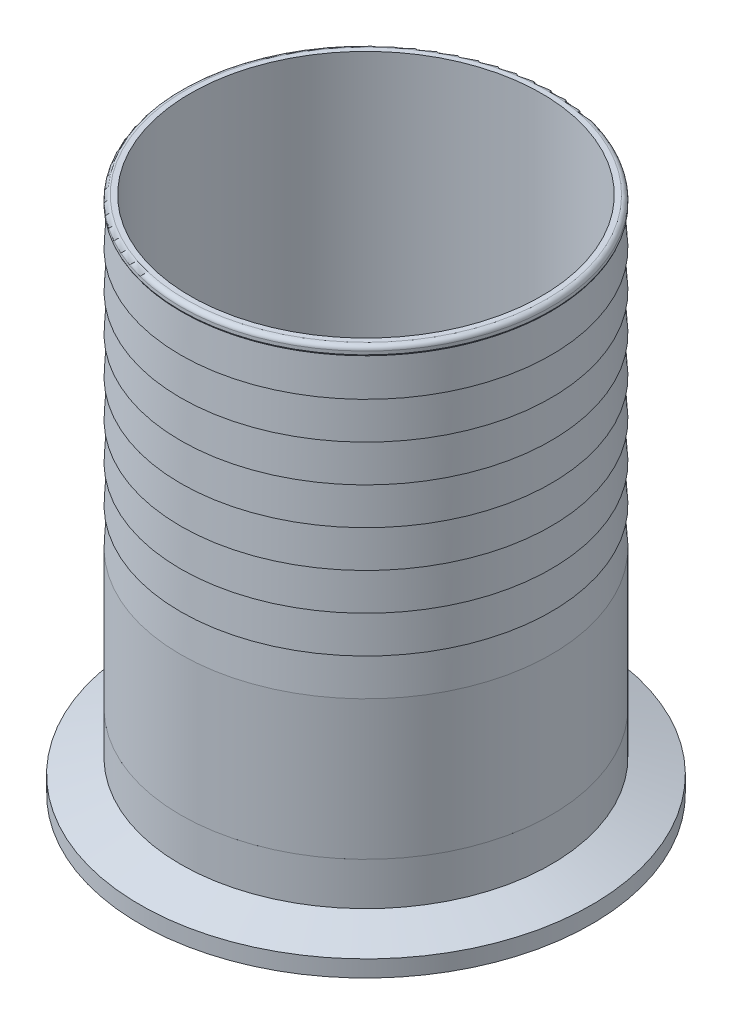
ISO-10303-21;
HEADER;
FILE_DESCRIPTION(('STEP AP214'),'2;1');
FILE_NAME('part.step','',(''),(''),'','','');
FILE_SCHEMA(('AUTOMOTIVE_DESIGN { 1 0 10303 214 1 1 1 1 }'));
ENDSEC;
DATA;
#1=APPLICATION_CONTEXT('core data for automotive mechanical design processes');
#2=APPLICATION_PROTOCOL_DEFINITION('international standard','automotive_design',2000,#1);
#3=PRODUCT_CONTEXT('',#1,'mechanical');
#4=PRODUCT('Part','Part','',(#3));
#5=PRODUCT_RELATED_PRODUCT_CATEGORY('part','',(#4));
#6=PRODUCT_DEFINITION_FORMATION('','',#4);
#7=PRODUCT_DEFINITION_CONTEXT('part definition',#1,'design');
#8=PRODUCT_DEFINITION('design','',#6,#7);
#9=PRODUCT_DEFINITION_SHAPE('','',#8);
#10=(LENGTH_UNIT() NAMED_UNIT(*) SI_UNIT(.MILLI.,.METRE.));
#11=(NAMED_UNIT(*) PLANE_ANGLE_UNIT() SI_UNIT($,.RADIAN.));
#12=(NAMED_UNIT(*) SI_UNIT($,.STERADIAN.) SOLID_ANGLE_UNIT());
#13=UNCERTAINTY_MEASURE_WITH_UNIT(LENGTH_MEASURE(1.E-05),#10,'distance_accuracy_value','');
#14=(GEOMETRIC_REPRESENTATION_CONTEXT(3) GLOBAL_UNCERTAINTY_ASSIGNED_CONTEXT((#13)) GLOBAL_UNIT_ASSIGNED_CONTEXT((#10,
#11,#12)) REPRESENTATION_CONTEXT('',''));
#15=CARTESIAN_POINT('',(0.,0.,0.));
#16=DIRECTION('',(0.,0.,1.));
#17=DIRECTION('',(1.,0.,0.));
#18=AXIS2_PLACEMENT_3D('',#15,#16,#17);
#19=CARTESIAN_POINT('',(42.3377708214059,43.5004491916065,31.3804772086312));
#20=DIRECTION('',(0.,-1.,0.));
#21=DIRECTION('',(-0.977270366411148,0.,-0.211996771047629));
#22=AXIS2_PLACEMENT_3D('',#19,#20,#21);
#23=PLANE('',#22);
#24=CARTESIAN_POINT('',(35.6068733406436,43.5004491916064,62.4088113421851));
#25=DIRECTION('',(0.,-1.,0.));
#26=DIRECTION('',(-0.977270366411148,0.,-0.211996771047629));
#27=AXIS2_PLACEMENT_3D('',#24,#25,#26);
#28=CIRCLE('',#27,30.099);
#29=CARTESIAN_POINT('',(6.19201258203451,43.5004491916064,56.0279205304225));
#30=VERTEX_POINT('',#29);
#31=EDGE_CURVE('P0_E85',#30,#30,#28,.T.);
#32=ORIENTED_EDGE('',*,*,#31,.F.);
#33=EDGE_LOOP('',(#32));
#34=FACE_BOUND('',#33,.T.);
#35=CARTESIAN_POINT('',(35.6068733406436,43.5004491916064,62.4088113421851));
#36=DIRECTION('',(0.,-1.,0.));
#37=DIRECTION('',(-0.977270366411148,0.,-0.211996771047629));
#38=AXIS2_PLACEMENT_3D('',#35,#36,#37);
#39=CIRCLE('',#38,31.75);
#40=CARTESIAN_POINT('',(4.57853920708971,43.5004491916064,55.6779138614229));
#41=VERTEX_POINT('',#40);
#42=EDGE_CURVE('P0_E9',#41,#41,#39,.T.);
#43=ORIENTED_EDGE('',*,*,#42,.T.);
#44=EDGE_LOOP('',(#43));
#45=FACE_BOUND('',#44,.T.);
#46=ADVANCED_FACE('P0_F14',(#34,#45),#23,.T.);
#47=CARTESIAN_POINT('',(35.6068733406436,43.5004491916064,62.4088113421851));
#48=DIRECTION('',(0.,-1.,0.));
#49=DIRECTION('',(-0.977270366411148,0.,-0.211996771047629));
#50=AXIS2_PLACEMENT_3D('',#47,#48,#49);
#51=CYLINDRICAL_SURFACE('',#50,31.75);
#52=CARTESIAN_POINT('',(35.6068733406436,67.3256491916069,62.4088113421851));
#53=DIRECTION('',(0.,-1.,0.));
#54=DIRECTION('',(-0.977270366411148,0.,-0.211996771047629));
#55=AXIS2_PLACEMENT_3D('',#52,#53,#54);
#56=CIRCLE('',#55,31.75);
#57=CARTESIAN_POINT('',(4.57853920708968,67.3256491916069,55.6779138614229));
#58=VERTEX_POINT('',#57);
#59=EDGE_CURVE('P0_E20',#58,#58,#56,.T.);
#60=ORIENTED_EDGE('',*,*,#59,.T.);
#61=EDGE_LOOP('',(#60));
#62=FACE_BOUND('',#61,.T.);
#63=ORIENTED_EDGE('',*,*,#42,.F.);
#64=EDGE_LOOP('',(#63));
#65=FACE_BOUND('',#64,.T.);
#66=ADVANCED_FACE('P0_F101',(#62,#65),#51,.T.);
#67=CARTESIAN_POINT('',(35.6068733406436,67.3256491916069,62.4088113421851));
#68=DIRECTION('',(0.,-1.,0.));
#69=DIRECTION('',(-0.977270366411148,0.,-0.211996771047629));
#70=AXIS2_PLACEMENT_3D('',#67,#68,#69);
#71=CONICAL_SURFACE('',#70,31.75,0.0599281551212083);
#72=CARTESIAN_POINT('',(35.6068733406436,73.6756491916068,62.4088113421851));
#73=DIRECTION('',(0.,-1.,0.));
#74=DIRECTION('',(-0.977270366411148,0.,-0.211996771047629));
#75=AXIS2_PLACEMENT_3D('',#72,#73,#74);
#76=CIRCLE('',#75,31.369);
#77=CARTESIAN_POINT('',(4.95087921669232,73.6756491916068,55.758684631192));
#78=VERTEX_POINT('',#77);
#79=EDGE_CURVE('P0_E24',#78,#78,#76,.T.);
#80=ORIENTED_EDGE('',*,*,#79,.T.);
#81=EDGE_LOOP('',(#80));
#82=FACE_BOUND('',#81,.T.);
#83=ORIENTED_EDGE('',*,*,#59,.F.);
#84=EDGE_LOOP('',(#83));
#85=FACE_BOUND('',#84,.T.);
#86=ADVANCED_FACE('P0_F106',(#82,#85),#71,.T.);
#87=CARTESIAN_POINT('',(42.3377708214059,73.6756491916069,31.3804772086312));
#88=DIRECTION('',(0.,-1.,0.));
#89=DIRECTION('',(-0.977270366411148,0.,-0.211996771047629));
#90=AXIS2_PLACEMENT_3D('',#87,#88,#89);
#91=PLANE('',#90);
#92=CARTESIAN_POINT('',(35.6068733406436,73.6756491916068,62.4088113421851));
#93=DIRECTION('',(0.,-1.,0.));
#94=DIRECTION('',(-0.977270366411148,0.,-0.211996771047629));
#95=AXIS2_PLACEMENT_3D('',#92,#93,#94);
#96=CIRCLE('',#95,31.75);
#97=CARTESIAN_POINT('',(4.57853920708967,73.6756491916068,55.6779138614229));
#98=VERTEX_POINT('',#97);
#99=EDGE_CURVE('P0_E28',#98,#98,#96,.T.);
#100=ORIENTED_EDGE('',*,*,#99,.T.);
#101=EDGE_LOOP('',(#100));
#102=FACE_BOUND('',#101,.T.);
#103=ORIENTED_EDGE('',*,*,#79,.F.);
#104=EDGE_LOOP('',(#103));
#105=FACE_BOUND('',#104,.T.);
#106=ADVANCED_FACE('P0_F110',(#102,#105),#91,.T.);
#107=CARTESIAN_POINT('',(35.6068733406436,73.6756491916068,62.4088113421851));
#108=DIRECTION('',(0.,-1.,0.));
#109=DIRECTION('',(-0.977270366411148,0.,-0.211996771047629));
#110=AXIS2_PLACEMENT_3D('',#107,#108,#109);
#111=CONICAL_SURFACE('',#110,31.75,0.0599281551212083);
#112=CARTESIAN_POINT('',(35.6068733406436,80.0256491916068,62.4088113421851));
#113=DIRECTION('',(0.,-1.,0.));
#114=DIRECTION('',(-0.977270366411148,0.,-0.211996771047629));
#115=AXIS2_PLACEMENT_3D('',#112,#113,#114);
#116=CIRCLE('',#115,31.369);
#117=CARTESIAN_POINT('',(4.95087921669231,80.0256491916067,55.7586846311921));
#118=VERTEX_POINT('',#117);
#119=EDGE_CURVE('P0_E33',#118,#118,#116,.T.);
#120=ORIENTED_EDGE('',*,*,#119,.T.);
#121=EDGE_LOOP('',(#120));
#122=FACE_BOUND('',#121,.T.);
#123=ORIENTED_EDGE('',*,*,#99,.F.);
#124=EDGE_LOOP('',(#123));
#125=FACE_BOUND('',#124,.T.);
#126=ADVANCED_FACE('P0_F117',(#122,#125),#111,.T.);
#127=CARTESIAN_POINT('',(42.3377708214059,80.0256491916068,31.3804772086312));
#128=DIRECTION('',(0.,-1.,0.));
#129=DIRECTION('',(-0.977270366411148,0.,-0.211996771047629));
#130=AXIS2_PLACEMENT_3D('',#127,#128,#129);
#131=PLANE('',#130);
#132=CARTESIAN_POINT('',(35.6068733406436,80.0256491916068,62.4088113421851));
#133=DIRECTION('',(0.,-1.,0.));
#134=DIRECTION('',(-0.977270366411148,0.,-0.211996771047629));
#135=AXIS2_PLACEMENT_3D('',#132,#133,#134);
#136=CIRCLE('',#135,31.75);
#137=CARTESIAN_POINT('',(4.57853920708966,80.0256491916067,55.6779138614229));
#138=VERTEX_POINT('',#137);
#139=EDGE_CURVE('P0_E36',#138,#138,#136,.T.);
#140=ORIENTED_EDGE('',*,*,#139,.T.);
#141=EDGE_LOOP('',(#140));
#142=FACE_BOUND('',#141,.T.);
#143=ORIENTED_EDGE('',*,*,#119,.F.);
#144=EDGE_LOOP('',(#143));
#145=FACE_BOUND('',#144,.T.);
#146=ADVANCED_FACE('P0_F121',(#142,#145),#131,.T.);
#147=CARTESIAN_POINT('',(35.6068733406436,80.0256491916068,62.4088113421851));
#148=DIRECTION('',(0.,-1.,0.));
#149=DIRECTION('',(-0.977270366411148,0.,-0.211996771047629));
#150=AXIS2_PLACEMENT_3D('',#147,#148,#149);
#151=CONICAL_SURFACE('',#150,31.75,0.0599281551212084);
#152=CARTESIAN_POINT('',(35.6068733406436,86.3756491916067,62.4088113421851));
#153=DIRECTION('',(0.,-1.,0.));
#154=DIRECTION('',(-0.977270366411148,0.,-0.211996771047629));
#155=AXIS2_PLACEMENT_3D('',#152,#153,#154);
#156=CIRCLE('',#155,31.369);
#157=CARTESIAN_POINT('',(4.9508792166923,86.3756491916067,55.7586846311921));
#158=VERTEX_POINT('',#157);
#159=EDGE_CURVE('P0_E39',#158,#158,#156,.T.);
#160=ORIENTED_EDGE('',*,*,#159,.T.);
#161=EDGE_LOOP('',(#160));
#162=FACE_BOUND('',#161,.T.);
#163=ORIENTED_EDGE('',*,*,#139,.F.);
#164=EDGE_LOOP('',(#163));
#165=FACE_BOUND('',#164,.T.);
#166=ADVANCED_FACE('P0_F125',(#162,#165),#151,.T.);
#167=CARTESIAN_POINT('',(42.3377708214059,86.3756491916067,31.3804772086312));
#168=DIRECTION('',(0.,-1.,0.));
#169=DIRECTION('',(-0.977270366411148,0.,-0.211996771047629));
#170=AXIS2_PLACEMENT_3D('',#167,#168,#169);
#171=PLANE('',#170);
#172=CARTESIAN_POINT('',(35.6068733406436,86.3756491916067,62.4088113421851));
#173=DIRECTION('',(0.,-1.,0.));
#174=DIRECTION('',(-0.977270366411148,0.,-0.211996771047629));
#175=AXIS2_PLACEMENT_3D('',#172,#173,#174);
#176=CIRCLE('',#175,31.75);
#177=CARTESIAN_POINT('',(4.57853920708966,86.3756491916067,55.6779138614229));
#178=VERTEX_POINT('',#177);
#179=EDGE_CURVE('P0_E42',#178,#178,#176,.T.);
#180=ORIENTED_EDGE('',*,*,#179,.T.);
#181=EDGE_LOOP('',(#180));
#182=FACE_BOUND('',#181,.T.);
#183=ORIENTED_EDGE('',*,*,#159,.F.);
#184=EDGE_LOOP('',(#183));
#185=FACE_BOUND('',#184,.T.);
#186=ADVANCED_FACE('P0_F129',(#182,#185),#171,.T.);
#187=CARTESIAN_POINT('',(35.6068733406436,86.3756491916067,62.4088113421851));
#188=DIRECTION('',(0.,-1.,0.));
#189=DIRECTION('',(-0.977270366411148,0.,-0.211996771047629));
#190=AXIS2_PLACEMENT_3D('',#187,#188,#189);
#191=CONICAL_SURFACE('',#190,31.75,0.0599281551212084);
#192=CARTESIAN_POINT('',(35.6068733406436,92.7256491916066,62.4088113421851));
#193=DIRECTION('',(0.,-1.,0.));
#194=DIRECTION('',(-0.977270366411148,0.,-0.211996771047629));
#195=AXIS2_PLACEMENT_3D('',#192,#193,#194);
#196=CIRCLE('',#195,31.369);
#197=CARTESIAN_POINT('',(4.9508792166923,92.7256491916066,55.7586846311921));
#198=VERTEX_POINT('',#197);
#199=EDGE_CURVE('P0_E45',#198,#198,#196,.T.);
#200=ORIENTED_EDGE('',*,*,#199,.T.);
#201=EDGE_LOOP('',(#200));
#202=FACE_BOUND('',#201,.T.);
#203=ORIENTED_EDGE('',*,*,#179,.F.);
#204=EDGE_LOOP('',(#203));
#205=FACE_BOUND('',#204,.T.);
#206=ADVANCED_FACE('P0_F133',(#202,#205),#191,.T.);
#207=CARTESIAN_POINT('',(42.3377708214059,92.7256491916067,31.3804772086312));
#208=DIRECTION('',(0.,-1.,0.));
#209=DIRECTION('',(-0.977270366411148,0.,-0.211996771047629));
#210=AXIS2_PLACEMENT_3D('',#207,#208,#209);
#211=PLANE('',#210);
#212=CARTESIAN_POINT('',(35.6068733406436,92.7256491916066,62.4088113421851));
#213=DIRECTION('',(0.,-1.,0.));
#214=DIRECTION('',(-0.977270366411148,0.,-0.211996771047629));
#215=AXIS2_PLACEMENT_3D('',#212,#213,#214);
#216=CIRCLE('',#215,31.75);
#217=CARTESIAN_POINT('',(4.57853920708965,92.7256491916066,55.6779138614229));
#218=VERTEX_POINT('',#217);
#219=EDGE_CURVE('P0_E48',#218,#218,#216,.T.);
#220=ORIENTED_EDGE('',*,*,#219,.T.);
#221=EDGE_LOOP('',(#220));
#222=FACE_BOUND('',#221,.T.);
#223=ORIENTED_EDGE('',*,*,#199,.F.);
#224=EDGE_LOOP('',(#223));
#225=FACE_BOUND('',#224,.T.);
#226=ADVANCED_FACE('P0_F137',(#222,#225),#211,.T.);
#227=CARTESIAN_POINT('',(35.6068733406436,92.7256491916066,62.4088113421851));
#228=DIRECTION('',(0.,-1.,0.));
#229=DIRECTION('',(-0.977270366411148,0.,-0.211996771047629));
#230=AXIS2_PLACEMENT_3D('',#227,#228,#229);
#231=CONICAL_SURFACE('',#230,31.75,0.0599281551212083);
#232=CARTESIAN_POINT('',(35.6068733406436,99.0756491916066,62.4088113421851));
#233=DIRECTION('',(0.,-1.,0.));
#234=DIRECTION('',(-0.977270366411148,0.,-0.211996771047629));
#235=AXIS2_PLACEMENT_3D('',#232,#233,#234);
#236=CIRCLE('',#235,31.369);
#237=CARTESIAN_POINT('',(4.95087921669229,99.0756491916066,55.7586846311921));
#238=VERTEX_POINT('',#237);
#239=EDGE_CURVE('P0_E51',#238,#238,#236,.T.);
#240=ORIENTED_EDGE('',*,*,#239,.T.);
#241=EDGE_LOOP('',(#240));
#242=FACE_BOUND('',#241,.T.);
#243=ORIENTED_EDGE('',*,*,#219,.F.);
#244=EDGE_LOOP('',(#243));
#245=FACE_BOUND('',#244,.T.);
#246=ADVANCED_FACE('P0_F141',(#242,#245),#231,.T.);
#247=CARTESIAN_POINT('',(42.3377708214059,99.0756491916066,31.3804772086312));
#248=DIRECTION('',(0.,-1.,0.));
#249=DIRECTION('',(-0.977270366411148,0.,-0.211996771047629));
#250=AXIS2_PLACEMENT_3D('',#247,#248,#249);
#251=PLANE('',#250);
#252=CARTESIAN_POINT('',(35.6068733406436,99.0756491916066,62.4088113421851));
#253=DIRECTION('',(0.,-1.,0.));
#254=DIRECTION('',(-0.977270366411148,0.,-0.211996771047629));
#255=AXIS2_PLACEMENT_3D('',#252,#253,#254);
#256=CIRCLE('',#255,31.75);
#257=CARTESIAN_POINT('',(4.57853920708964,99.0756491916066,55.6779138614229));
#258=VERTEX_POINT('',#257);
#259=EDGE_CURVE('P0_E54',#258,#258,#256,.T.);
#260=ORIENTED_EDGE('',*,*,#259,.T.);
#261=EDGE_LOOP('',(#260));
#262=FACE_BOUND('',#261,.T.);
#263=ORIENTED_EDGE('',*,*,#239,.F.);
#264=EDGE_LOOP('',(#263));
#265=FACE_BOUND('',#264,.T.);
#266=ADVANCED_FACE('P0_F145',(#262,#265),#251,.T.);
#267=CARTESIAN_POINT('',(35.6068733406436,99.0756491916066,62.4088113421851));
#268=DIRECTION('',(0.,-1.,0.));
#269=DIRECTION('',(-0.977270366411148,0.,-0.211996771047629));
#270=AXIS2_PLACEMENT_3D('',#267,#268,#269);
#271=CONICAL_SURFACE('',#270,31.75,0.0599281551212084);
#272=CARTESIAN_POINT('',(35.6068733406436,105.425649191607,62.4088113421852));
#273=DIRECTION('',(0.,-1.,0.));
#274=DIRECTION('',(-0.977270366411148,0.,-0.211996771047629));
#275=AXIS2_PLACEMENT_3D('',#272,#273,#274);
#276=CIRCLE('',#275,31.369);
#277=CARTESIAN_POINT('',(4.95087921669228,105.425649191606,55.7586846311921));
#278=VERTEX_POINT('',#277);
#279=EDGE_CURVE('P0_E57',#278,#278,#276,.T.);
#280=ORIENTED_EDGE('',*,*,#279,.T.);
#281=EDGE_LOOP('',(#280));
#282=FACE_BOUND('',#281,.T.);
#283=ORIENTED_EDGE('',*,*,#259,.F.);
#284=EDGE_LOOP('',(#283));
#285=FACE_BOUND('',#284,.T.);
#286=ADVANCED_FACE('P0_F149',(#282,#285),#271,.T.);
#287=CARTESIAN_POINT('',(42.3377708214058,105.425649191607,31.3804772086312));
#288=DIRECTION('',(0.,-1.,0.));
#289=DIRECTION('',(-0.977270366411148,0.,-0.211996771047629));
#290=AXIS2_PLACEMENT_3D('',#287,#288,#289);
#291=PLANE('',#290);
#292=CARTESIAN_POINT('',(35.6068733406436,105.425649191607,62.4088113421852));
#293=DIRECTION('',(0.,-1.,0.));
#294=DIRECTION('',(-0.977270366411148,0.,-0.211996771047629));
#295=AXIS2_PLACEMENT_3D('',#292,#293,#294);
#296=CIRCLE('',#295,31.75);
#297=CARTESIAN_POINT('',(4.57853920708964,105.425649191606,55.677913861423));
#298=VERTEX_POINT('',#297);
#299=EDGE_CURVE('P0_E60',#298,#298,#296,.T.);
#300=ORIENTED_EDGE('',*,*,#299,.T.);
#301=EDGE_LOOP('',(#300));
#302=FACE_BOUND('',#301,.T.);
#303=ORIENTED_EDGE('',*,*,#279,.F.);
#304=EDGE_LOOP('',(#303));
#305=FACE_BOUND('',#304,.T.);
#306=ADVANCED_FACE('P0_F153',(#302,#305),#291,.T.);
#307=CARTESIAN_POINT('',(35.6068733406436,105.425649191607,62.4088113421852));
#308=DIRECTION('',(0.,-1.,0.));
#309=DIRECTION('',(-0.977270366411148,0.,-0.211996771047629));
#310=AXIS2_PLACEMENT_3D('',#307,#308,#309);
#311=CONICAL_SURFACE('',#310,31.75,0.0599281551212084);
#312=CARTESIAN_POINT('',(35.6068733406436,111.775649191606,62.4088113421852));
#313=DIRECTION('',(0.,-1.,0.));
#314=DIRECTION('',(-0.977270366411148,0.,-0.211996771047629));
#315=AXIS2_PLACEMENT_3D('',#312,#313,#314);
#316=CIRCLE('',#315,31.369);
#317=CARTESIAN_POINT('',(4.95087921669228,111.775649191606,55.7586846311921));
#318=VERTEX_POINT('',#317);
#319=EDGE_CURVE('P0_E63',#318,#318,#316,.T.);
#320=ORIENTED_EDGE('',*,*,#319,.T.);
#321=EDGE_LOOP('',(#320));
#322=FACE_BOUND('',#321,.T.);
#323=ORIENTED_EDGE('',*,*,#299,.F.);
#324=EDGE_LOOP('',(#323));
#325=FACE_BOUND('',#324,.T.);
#326=ADVANCED_FACE('P0_F157',(#322,#325),#311,.T.);
#327=CARTESIAN_POINT('',(42.3377708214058,111.775649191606,31.3804772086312));
#328=DIRECTION('',(0.,-1.,0.));
#329=DIRECTION('',(-0.977270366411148,0.,-0.211996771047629));
#330=AXIS2_PLACEMENT_3D('',#327,#328,#329);
#331=PLANE('',#330);
#332=CARTESIAN_POINT('',(35.6068733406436,111.775649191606,62.4088113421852));
#333=DIRECTION('',(0.,-1.,0.));
#334=DIRECTION('',(-0.977270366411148,0.,-0.211996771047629));
#335=AXIS2_PLACEMENT_3D('',#332,#333,#334);
#336=CIRCLE('',#335,31.75);
#337=CARTESIAN_POINT('',(4.57853920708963,111.775649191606,55.677913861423));
#338=VERTEX_POINT('',#337);
#339=EDGE_CURVE('P0_E66',#338,#338,#336,.T.);
#340=ORIENTED_EDGE('',*,*,#339,.T.);
#341=EDGE_LOOP('',(#340));
#342=FACE_BOUND('',#341,.T.);
#343=ORIENTED_EDGE('',*,*,#319,.F.);
#344=EDGE_LOOP('',(#343));
#345=FACE_BOUND('',#344,.T.);
#346=ADVANCED_FACE('P0_F161',(#342,#345),#331,.T.);
#347=CARTESIAN_POINT('',(35.6068733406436,111.775649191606,62.4088113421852));
#348=DIRECTION('',(0.,-1.,0.));
#349=DIRECTION('',(-0.977270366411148,0.,-0.211996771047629));
#350=AXIS2_PLACEMENT_3D('',#347,#348,#349);
#351=CONICAL_SURFACE('',#350,31.75,0.0599281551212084);
#352=CARTESIAN_POINT('',(35.6068733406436,118.125649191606,62.4088113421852));
#353=DIRECTION('',(0.,-1.,0.));
#354=DIRECTION('',(-0.977270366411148,0.,-0.211996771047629));
#355=AXIS2_PLACEMENT_3D('',#352,#353,#354);
#356=CIRCLE('',#355,31.369);
#357=CARTESIAN_POINT('',(4.95087921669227,118.125649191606,55.7586846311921));
#358=VERTEX_POINT('',#357);
#359=EDGE_CURVE('P0_E69',#358,#358,#356,.T.);
#360=ORIENTED_EDGE('',*,*,#359,.T.);
#361=EDGE_LOOP('',(#360));
#362=FACE_BOUND('',#361,.T.);
#363=ORIENTED_EDGE('',*,*,#339,.F.);
#364=EDGE_LOOP('',(#363));
#365=FACE_BOUND('',#364,.T.);
#366=ADVANCED_FACE('P0_F165',(#362,#365),#351,.T.);
#367=CARTESIAN_POINT('',(42.2839236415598,118.125649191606,31.6287038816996));
#368=DIRECTION('',(0.,-1.,0.));
#369=DIRECTION('',(-0.977270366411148,0.,-0.211996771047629));
#370=AXIS2_PLACEMENT_3D('',#367,#368,#369);
#371=PLANE('',#370);
#372=CARTESIAN_POINT('',(35.6068733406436,118.125649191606,62.4088113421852));
#373=DIRECTION('',(0.,-1.,0.));
#374=DIRECTION('',(-0.977270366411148,0.,-0.211996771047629));
#375=AXIS2_PLACEMENT_3D('',#372,#373,#374);
#376=CIRCLE('',#375,31.496);
#377=CARTESIAN_POINT('',(4.82676588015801,118.125649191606,55.7317610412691));
#378=VERTEX_POINT('',#377);
#379=EDGE_CURVE('P0_E72',#378,#378,#376,.T.);
#380=ORIENTED_EDGE('',*,*,#379,.T.);
#381=EDGE_LOOP('',(#380));
#382=FACE_BOUND('',#381,.T.);
#383=ORIENTED_EDGE('',*,*,#359,.F.);
#384=EDGE_LOOP('',(#383));
#385=FACE_BOUND('',#384,.T.);
#386=ADVANCED_FACE('P0_F169',(#382,#385),#371,.T.);
#387=CARTESIAN_POINT('',(35.6068733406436,118.379649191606,62.4088113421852));
#388=DIRECTION('',(0.,-1.,0.));
#389=DIRECTION('',(-0.977270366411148,0.,-0.211996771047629));
#390=AXIS2_PLACEMENT_3D('',#387,#388,#389);
#391=TOROIDAL_SURFACE('',#390,31.496,0.254000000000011);
#392=CARTESIAN_POINT('',(35.6068733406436,118.379649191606,62.4088113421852));
#393=DIRECTION('',(0.,-1.,0.));
#394=DIRECTION('',(-0.977270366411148,0.,-0.211996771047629));
#395=AXIS2_PLACEMENT_3D('',#392,#393,#394);
#396=CIRCLE('',#395,31.75);
#397=CARTESIAN_POINT('',(4.57853920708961,118.379649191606,55.677913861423));
#398=VERTEX_POINT('',#397);
#399=EDGE_CURVE('P0_E75',#398,#398,#396,.T.);
#400=ORIENTED_EDGE('',*,*,#399,.T.);
#401=EDGE_LOOP('',(#400));
#402=FACE_BOUND('',#401,.T.);
#403=ORIENTED_EDGE('',*,*,#379,.F.);
#404=EDGE_LOOP('',(#403));
#405=FACE_BOUND('',#404,.T.);
#406=ADVANCED_FACE('P0_F173',(#402,#405),#391,.T.);
#407=CARTESIAN_POINT('',(35.6068733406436,43.5004491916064,62.4088113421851));
#408=DIRECTION('',(0.,-1.,0.));
#409=DIRECTION('',(-0.977270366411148,0.,-0.211996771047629));
#410=AXIS2_PLACEMENT_3D('',#407,#408,#409);
#411=CYLINDRICAL_SURFACE('',#410,31.75);
#412=CARTESIAN_POINT('',(35.6068733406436,118.938449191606,62.4088113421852));
#413=DIRECTION('',(0.,-1.,0.));
#414=DIRECTION('',(-0.977270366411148,0.,-0.211996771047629));
#415=AXIS2_PLACEMENT_3D('',#412,#413,#414);
#416=CIRCLE('',#415,31.75);
#417=CARTESIAN_POINT('',(4.57853920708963,118.938449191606,55.677913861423));
#418=VERTEX_POINT('',#417);
#419=EDGE_CURVE('P0_E78',#418,#418,#416,.T.);
#420=ORIENTED_EDGE('',*,*,#419,.T.);
#421=EDGE_LOOP('',(#420));
#422=FACE_BOUND('',#421,.T.);
#423=ORIENTED_EDGE('',*,*,#399,.F.);
#424=EDGE_LOOP('',(#423));
#425=FACE_BOUND('',#424,.T.);
#426=ADVANCED_FACE('P0_F177',(#422,#425),#411,.T.);
#427=CARTESIAN_POINT('',(35.6068733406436,118.938449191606,62.4088113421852));
#428=DIRECTION('',(0.,-1.,0.));
#429=DIRECTION('',(-0.977270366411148,0.,-0.211996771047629));
#430=AXIS2_PLACEMENT_3D('',#427,#428,#429);
#431=TOROIDAL_SURFACE('',#430,30.988,0.761999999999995);
#432=CARTESIAN_POINT('',(35.6068733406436,119.700449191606,62.4088113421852));
#433=DIRECTION('',(0.,-1.,0.));
#434=DIRECTION('',(-0.977270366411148,0.,-0.211996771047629));
#435=AXIS2_PLACEMENT_3D('',#432,#433,#434);
#436=CIRCLE('',#435,30.988);
#437=CARTESIAN_POINT('',(5.32321922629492,119.700449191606,55.8394554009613));
#438=VERTEX_POINT('',#437);
#439=EDGE_CURVE('P0_E81',#438,#438,#436,.T.);
#440=ORIENTED_EDGE('',*,*,#439,.T.);
#441=EDGE_LOOP('',(#440));
#442=FACE_BOUND('',#441,.T.);
#443=ORIENTED_EDGE('',*,*,#419,.F.);
#444=EDGE_LOOP('',(#443));
#445=FACE_BOUND('',#444,.T.);
#446=ADVANCED_FACE('P0_F181',(#442,#445),#431,.T.);
#447=CARTESIAN_POINT('',(35.6068733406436,119.700449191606,62.4088113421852));
#448=DIRECTION('',(0.,1.,0.));
#449=DIRECTION('',(0.977270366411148,0.,0.211996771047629));
#450=AXIS2_PLACEMENT_3D('',#447,#448,#449);
#451=PLANE('',#450);
#452=CARTESIAN_POINT('',(35.6068733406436,119.700449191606,62.4088113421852));
#453=DIRECTION('',(0.,-1.,0.));
#454=DIRECTION('',(-0.977270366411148,0.,-0.211996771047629));
#455=AXIS2_PLACEMENT_3D('',#452,#453,#454);
#456=CIRCLE('',#455,30.099);
#457=CARTESIAN_POINT('',(6.19201258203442,119.700449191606,56.0279205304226));
#458=VERTEX_POINT('',#457);
#459=EDGE_CURVE('P0_E84',#458,#458,#456,.T.);
#460=ORIENTED_EDGE('',*,*,#459,.T.);
#461=EDGE_LOOP('',(#460));
#462=FACE_BOUND('',#461,.T.);
#463=ORIENTED_EDGE('',*,*,#439,.F.);
#464=EDGE_LOOP('',(#463));
#465=FACE_BOUND('',#464,.T.);
#466=ADVANCED_FACE('P0_F91',(#462,#465),#451,.T.);
#467=CARTESIAN_POINT('',(35.6068733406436,119.700449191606,62.4088113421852));
#468=DIRECTION('',(0.,-1.,0.));
#469=DIRECTION('',(-0.977270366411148,0.,-0.211996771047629));
#470=AXIS2_PLACEMENT_3D('',#467,#468,#469);
#471=CYLINDRICAL_SURFACE('',#470,30.099);
#472=CARTESIAN_POINT('',(6.19201258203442,119.700449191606,56.0279205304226));
#473=CARTESIAN_POINT('',(6.19201258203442,118.906699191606,56.0279205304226));
#474=CARTESIAN_POINT('',(6.19201258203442,118.112949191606,56.0279205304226));
#475=CARTESIAN_POINT('',(6.19201258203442,116.525449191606,56.0279205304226));
#476=CARTESIAN_POINT('',(6.19201258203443,115.731699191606,56.0279205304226));
#477=CARTESIAN_POINT('',(6.19201258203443,114.144199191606,56.0279205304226));
#478=CARTESIAN_POINT('',(6.19201258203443,113.350449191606,56.0279205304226));
#479=CARTESIAN_POINT('',(6.19201258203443,111.762949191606,56.0279205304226));
#480=CARTESIAN_POINT('',(6.19201258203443,110.969199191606,56.0279205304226));
#481=CARTESIAN_POINT('',(6.19201258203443,109.381699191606,56.0279205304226));
#482=CARTESIAN_POINT('',(6.19201258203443,108.587949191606,56.0279205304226));
#483=CARTESIAN_POINT('',(6.19201258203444,107.000449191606,56.0279205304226));
#484=CARTESIAN_POINT('',(6.19201258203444,106.206699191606,56.0279205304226));
#485=CARTESIAN_POINT('',(6.19201258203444,104.619199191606,56.0279205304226));
#486=CARTESIAN_POINT('',(6.19201258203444,103.825449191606,56.0279205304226));
#487=CARTESIAN_POINT('',(6.19201258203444,102.237949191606,56.0279205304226));
#488=CARTESIAN_POINT('',(6.19201258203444,101.444199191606,56.0279205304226));
#489=CARTESIAN_POINT('',(6.19201258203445,99.8566991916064,56.0279205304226));
#490=CARTESIAN_POINT('',(6.19201258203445,99.0629491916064,56.0279205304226));
#491=CARTESIAN_POINT('',(6.19201258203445,97.4754491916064,56.0279205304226));
#492=CARTESIAN_POINT('',(6.19201258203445,96.6816991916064,56.0279205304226));
#493=CARTESIAN_POINT('',(6.19201258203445,95.0941991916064,56.0279205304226));
#494=CARTESIAN_POINT('',(6.19201258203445,94.3004491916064,56.0279205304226));
#495=CARTESIAN_POINT('',(6.19201258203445,92.7129491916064,56.0279205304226));
#496=CARTESIAN_POINT('',(6.19201258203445,91.9191991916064,56.0279205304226));
#497=CARTESIAN_POINT('',(6.19201258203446,90.3316991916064,56.0279205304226));
#498=CARTESIAN_POINT('',(6.19201258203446,89.5379491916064,56.0279205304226));
#499=CARTESIAN_POINT('',(6.19201258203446,87.9504491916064,56.0279205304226));
#500=CARTESIAN_POINT('',(6.19201258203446,87.1566991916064,56.0279205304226));
#501=CARTESIAN_POINT('',(6.19201258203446,85.5691991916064,56.0279205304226));
#502=CARTESIAN_POINT('',(6.19201258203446,84.7754491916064,56.0279205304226));
#503=CARTESIAN_POINT('',(6.19201258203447,83.1879491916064,56.0279205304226));
#504=CARTESIAN_POINT('',(6.19201258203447,82.3941991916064,56.0279205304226));
#505=CARTESIAN_POINT('',(6.19201258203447,80.8066991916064,56.0279205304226));
#506=CARTESIAN_POINT('',(6.19201258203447,80.0129491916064,56.0279205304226));
#507=CARTESIAN_POINT('',(6.19201258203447,78.4254491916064,56.0279205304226));
#508=CARTESIAN_POINT('',(6.19201258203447,77.6316991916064,56.0279205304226));
#509=CARTESIAN_POINT('',(6.19201258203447,76.0441991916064,56.0279205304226));
#510=CARTESIAN_POINT('',(6.19201258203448,75.2504491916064,56.0279205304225));
#511=CARTESIAN_POINT('',(6.19201258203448,73.6629491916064,56.0279205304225));
#512=CARTESIAN_POINT('',(6.19201258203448,72.8691991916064,56.0279205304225));
#513=CARTESIAN_POINT('',(6.19201258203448,71.2816991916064,56.0279205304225));
#514=CARTESIAN_POINT('',(6.19201258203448,70.4879491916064,56.0279205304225));
#515=CARTESIAN_POINT('',(6.19201258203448,68.9004491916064,56.0279205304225));
#516=CARTESIAN_POINT('',(6.19201258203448,68.1066991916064,56.0279205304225));
#517=CARTESIAN_POINT('',(6.19201258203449,66.5191991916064,56.0279205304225));
#518=CARTESIAN_POINT('',(6.19201258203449,65.7254491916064,56.0279205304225));
#519=CARTESIAN_POINT('',(6.19201258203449,64.1379491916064,56.0279205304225));
#520=CARTESIAN_POINT('',(6.19201258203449,63.3441991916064,56.0279205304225));
#521=CARTESIAN_POINT('',(6.19201258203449,61.7566991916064,56.0279205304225));
#522=CARTESIAN_POINT('',(6.19201258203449,60.9629491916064,56.0279205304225));
#523=CARTESIAN_POINT('',(6.19201258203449,59.3754491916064,56.0279205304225));
#524=CARTESIAN_POINT('',(6.1920125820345,58.5816991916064,56.0279205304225));
#525=CARTESIAN_POINT('',(6.1920125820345,56.9941991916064,56.0279205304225));
#526=CARTESIAN_POINT('',(6.1920125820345,56.2004491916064,56.0279205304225));
#527=CARTESIAN_POINT('',(6.1920125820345,54.6129491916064,56.0279205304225));
#528=CARTESIAN_POINT('',(6.1920125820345,53.8191991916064,56.0279205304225));
#529=CARTESIAN_POINT('',(6.1920125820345,52.2316991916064,56.0279205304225));
#530=CARTESIAN_POINT('',(6.1920125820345,51.4379491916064,56.0279205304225));
#531=CARTESIAN_POINT('',(6.19201258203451,49.8504491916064,56.0279205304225));
#532=CARTESIAN_POINT('',(6.19201258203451,49.0566991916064,56.0279205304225));
#533=CARTESIAN_POINT('',(6.19201258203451,47.4691991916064,56.0279205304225));
#534=CARTESIAN_POINT('',(6.19201258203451,46.6754491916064,56.0279205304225));
#535=CARTESIAN_POINT('',(6.19201258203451,45.0879491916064,56.0279205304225));
#536=CARTESIAN_POINT('',(6.19201258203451,44.2941991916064,56.0279205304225));
#537=CARTESIAN_POINT('',(6.19201258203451,43.5004491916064,56.0279205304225));
#538=B_SPLINE_CURVE_WITH_KNOTS('',3,(#472,#473,#474,#475,#476,#477,#478,#479,#480,#481,#482,
#483,#484,#485,#486,#487,#488,#489,#490,#491,#492,#493,#494,#495,#496,#497,#498,#499,#500,#501,
#502,#503,#504,#505,#506,#507,#508,#509,#510,#511,#512,#513,#514,#515,#516,#517,#518,#519,#520,
#521,#522,#523,#524,#525,#526,#527,#528,#529,#530,#531,#532,#533,#534,#535,#536,#537),
.UNSPECIFIED.,.F.,.F.,(4,2,2,2,2,2,2,2,2,2,2,2,2,2,2,2,2,2,2,2,2,2,2,2,2,2,2,2,2,2,2,2,4),(0.,
2.38124999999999,4.76249999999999,7.14374999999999,9.52499999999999,11.90625,14.2875,16.66875,
19.05,21.43125,23.8125,26.19375,28.575,30.95625,33.3375,35.71875,38.1,40.48125,42.8625,45.24375,
47.625,50.00625,52.3875,54.76875,57.15,59.53125,61.9125,64.29375,66.675,69.05625,71.4375,
73.81875,76.2),.UNSPECIFIED.);
#539=EDGE_CURVE('P0_BSEAM94',#458,#30,#538,.T.);
#540=ORIENTED_EDGE('',*,*,#459,.F.);
#541=ORIENTED_EDGE('',*,*,#31,.T.);
#542=ORIENTED_EDGE('',*,*,#539,.T.);
#543=ORIENTED_EDGE('',*,*,#539,.F.);
#544=EDGE_LOOP('',(#540,#542,#541,#543));
#545=FACE_BOUND('',#544,.T.);
#546=ADVANCED_FACE('P0_F94',(#545),#471,.F.);
#547=CLOSED_SHELL('',(#46,#66,#86,#106,#126,#146,#166,#186,#206,#226,#246,#266,#286,#306,#326,
#346,#366,#386,#406,#426,#446,#466,#546));
#548=MANIFOLD_SOLID_BREP('P0_B1',#547);
#549=CARTESIAN_POINT('',(35.6068733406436,31.5878491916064,62.4088113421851));
#550=DIRECTION('',(0.,-1.00000000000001,0.));
#551=DIRECTION('',(0.,0.,-1.));
#552=AXIS2_PLACEMENT_3D('',#549,#550,#551);
#553=TOROIDAL_SURFACE('',#552,37.1367084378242,0.787400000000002);
#554=CARTESIAN_POINT('',(35.6068733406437,30.8004491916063,62.4088113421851));
#555=DIRECTION('',(0.,-1.00000000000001,0.));
#556=DIRECTION('',(0.,0.,-1.));
#557=AXIS2_PLACEMENT_3D('',#554,#555,#556);
#558=CIRCLE('',#557,37.1367084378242);
#559=CARTESIAN_POINT('',(35.6068733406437,30.8004491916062,25.2721029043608));
#560=VERTEX_POINT('',#559);
#561=EDGE_CURVE('P1_E49',#560,#560,#558,.T.);
#562=ORIENTED_EDGE('',*,*,#561,.T.);
#563=EDGE_LOOP('',(#562));
#564=FACE_BOUND('',#563,.T.);
#565=CARTESIAN_POINT('',(35.6068733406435,31.2749081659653,62.4088113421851));
#566=DIRECTION('',(0.,-1.00000000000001,0.));
#567=DIRECTION('',(0.,0.,-1.));
#568=AXIS2_PLACEMENT_3D('',#565,#566,#567);
#569=CIRCLE('',#568,36.4141666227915);
#570=CARTESIAN_POINT('',(35.6068733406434,31.2749081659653,25.9946447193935));
#571=VERTEX_POINT('',#570);
#572=EDGE_CURVE('P1_E10',#571,#571,#569,.T.);
#573=ORIENTED_EDGE('',*,*,#572,.F.);
#574=EDGE_LOOP('',(#573));
#575=FACE_BOUND('',#574,.T.);
#576=ADVANCED_FACE('P1_F15',(#564,#575),#553,.T.);
#577=CARTESIAN_POINT('',(35.6068733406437,30.8004491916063,62.4088113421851));
#578=DIRECTION('',(0.,-1.00000000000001,0.));
#579=DIRECTION('',(0.,0.,-1.));
#580=AXIS2_PLACEMENT_3D('',#577,#578,#579);
#581=TOROIDAL_SURFACE('',#580,35.3187,1.1938);
#582=CARTESIAN_POINT('',(35.6068733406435,31.2749081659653,62.4088113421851));
#583=DIRECTION('',(0.,-1.00000000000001,0.));
#584=DIRECTION('',(0.,0.,-1.));
#585=AXIS2_PLACEMENT_3D('',#582,#583,#584);
#586=CIRCLE('',#585,34.2232333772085);
#587=CARTESIAN_POINT('',(35.6068733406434,31.2749081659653,28.1855779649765));
#588=VERTEX_POINT('',#587);
#589=EDGE_CURVE('P1_E21',#588,#588,#586,.T.);
#590=ORIENTED_EDGE('',*,*,#589,.F.);
#591=EDGE_LOOP('',(#590));
#592=FACE_BOUND('',#591,.T.);
#593=ORIENTED_EDGE('',*,*,#572,.T.);
#594=EDGE_LOOP('',(#593));
#595=FACE_BOUND('',#594,.T.);
#596=ADVANCED_FACE('P1_F98',(#592,#595),#581,.F.);
#597=CARTESIAN_POINT('',(35.6068733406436,31.5878491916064,62.4088113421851));
#598=DIRECTION('',(0.,-1.00000000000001,0.));
#599=DIRECTION('',(0.,0.,-1.));
#600=AXIS2_PLACEMENT_3D('',#597,#598,#599);
#601=TOROIDAL_SURFACE('',#600,33.5006915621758,0.787399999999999);
#602=ORIENTED_EDGE('',*,*,#589,.T.);
#603=EDGE_LOOP('',(#602));
#604=FACE_BOUND('',#603,.T.);
#605=CARTESIAN_POINT('',(35.6068733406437,30.8004491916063,62.4088113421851));
#606=DIRECTION('',(0.,-1.00000000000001,0.));
#607=DIRECTION('',(0.,0.,-1.));
#608=AXIS2_PLACEMENT_3D('',#605,#606,#607);
#609=CIRCLE('',#608,33.5006915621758);
#610=CARTESIAN_POINT('',(35.6068733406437,30.8004491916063,28.9081197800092));
#611=VERTEX_POINT('',#610);
#612=EDGE_CURVE('P1_E25',#611,#611,#609,.T.);
#613=ORIENTED_EDGE('',*,*,#612,.F.);
#614=EDGE_LOOP('',(#613));
#615=FACE_BOUND('',#614,.T.);
#616=ADVANCED_FACE('P1_F94',(#604,#615),#601,.T.);
#617=CARTESIAN_POINT('',(35.6068733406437,30.8004491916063,62.4088113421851));
#618=DIRECTION('',(0.,1.00000000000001,0.));
#619=DIRECTION('',(0.,0.,1.));
#620=AXIS2_PLACEMENT_3D('',#617,#618,#619);
#621=PLANE('',#620);
#622=CARTESIAN_POINT('',(35.6068733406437,30.8004491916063,62.4088113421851));
#623=DIRECTION('',(0.,-1.00000000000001,0.));
#624=DIRECTION('',(0.,0.,-1.));
#625=AXIS2_PLACEMENT_3D('',#622,#623,#624);
#626=CIRCLE('',#625,30.099);
#627=CARTESIAN_POINT('',(35.6068733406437,30.8004491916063,32.309811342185));
#628=VERTEX_POINT('',#627);
#629=EDGE_CURVE('P1_E29',#628,#628,#626,.T.);
#630=ORIENTED_EDGE('',*,*,#629,.F.);
#631=EDGE_LOOP('',(#630));
#632=FACE_BOUND('',#631,.T.);
#633=ORIENTED_EDGE('',*,*,#612,.T.);
#634=EDGE_LOOP('',(#633));
#635=FACE_BOUND('',#634,.T.);
#636=ADVANCED_FACE('P1_F87',(#632,#635),#621,.F.);
#637=CARTESIAN_POINT('',(35.6068733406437,30.8004491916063,62.4088113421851));
#638=DIRECTION('',(0.,-1.00000000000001,0.));
#639=DIRECTION('',(0.,0.,-1.));
#640=AXIS2_PLACEMENT_3D('',#637,#638,#639);
#641=CYLINDRICAL_SURFACE('',#640,30.099);
#642=ORIENTED_EDGE('',*,*,#629,.T.);
#643=EDGE_LOOP('',(#642));
#644=FACE_BOUND('',#643,.T.);
#645=CARTESIAN_POINT('',(35.6068733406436,43.5004491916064,62.4088113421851));
#646=DIRECTION('',(0.,-1.00000000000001,0.));
#647=DIRECTION('',(0.,0.,-1.));
#648=AXIS2_PLACEMENT_3D('',#645,#646,#647);
#649=CIRCLE('',#648,30.099);
#650=CARTESIAN_POINT('',(35.6068733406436,43.5004491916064,32.309811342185));
#651=VERTEX_POINT('',#650);
#652=EDGE_CURVE('P1_E34',#651,#651,#649,.T.);
#653=ORIENTED_EDGE('',*,*,#652,.F.);
#654=EDGE_LOOP('',(#653));
#655=FACE_BOUND('',#654,.T.);
#656=ADVANCED_FACE('P1_F82',(#644,#655),#641,.F.);
#657=CARTESIAN_POINT('',(35.6068733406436,43.5004491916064,62.4088113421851));
#658=DIRECTION('',(0.,-1.00000000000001,0.));
#659=DIRECTION('',(0.,0.,-1.));
#660=AXIS2_PLACEMENT_3D('',#657,#658,#659);
#661=PLANE('',#660);
#662=CARTESIAN_POINT('',(35.6068733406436,43.5004491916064,62.4088113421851));
#663=DIRECTION('',(0.,-1.00000000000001,0.));
#664=DIRECTION('',(0.,0.,-1.));
#665=AXIS2_PLACEMENT_3D('',#662,#663,#664);
#666=CIRCLE('',#665,31.75);
#667=CARTESIAN_POINT('',(35.6068733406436,43.5004491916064,30.658811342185));
#668=VERTEX_POINT('',#667);
#669=EDGE_CURVE('P1_E37',#668,#668,#666,.T.);
#670=ORIENTED_EDGE('',*,*,#669,.F.);
#671=EDGE_LOOP('',(#670));
#672=FACE_BOUND('',#671,.T.);
#673=ORIENTED_EDGE('',*,*,#652,.T.);
#674=EDGE_LOOP('',(#673));
#675=FACE_BOUND('',#674,.T.);
#676=ADVANCED_FACE('P1_F76',(#672,#675),#661,.F.);
#677=CARTESIAN_POINT('',(35.6068733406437,30.8004491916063,62.4088113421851));
#678=DIRECTION('',(0.,-1.00000000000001,0.));
#679=DIRECTION('',(0.,0.,-1.));
#680=AXIS2_PLACEMENT_3D('',#677,#678,#679);
#681=CYLINDRICAL_SURFACE('',#680,31.75);
#682=CARTESIAN_POINT('',(35.6068733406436,36.1783364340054,62.4088113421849));
#683=DIRECTION('',(0.,-1.00000000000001,0.));
#684=DIRECTION('',(0.,0.,-1.));
#685=AXIS2_PLACEMENT_3D('',#682,#683,#684);
#686=CIRCLE('',#685,31.75);
#687=CARTESIAN_POINT('',(35.6068733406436,36.1783364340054,30.6588113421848));
#688=VERTEX_POINT('',#687);
#689=EDGE_CURVE('P1_E40',#688,#688,#686,.T.);
#690=ORIENTED_EDGE('',*,*,#689,.F.);
#691=EDGE_LOOP('',(#690));
#692=FACE_BOUND('',#691,.T.);
#693=ORIENTED_EDGE('',*,*,#669,.T.);
#694=EDGE_LOOP('',(#693));
#695=FACE_BOUND('',#694,.T.);
#696=ADVANCED_FACE('P1_F70',(#692,#695),#681,.T.);
#697=CARTESIAN_POINT('',(35.6068733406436,36.1783364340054,62.4088113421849));
#698=DIRECTION('',(0.,-1.00000000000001,0.));
#699=DIRECTION('',(0.,0.,-1.));
#700=AXIS2_PLACEMENT_3D('',#697,#698,#699);
#701=CONICAL_SURFACE('',#700,31.75,1.22173047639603);
#702=CARTESIAN_POINT('',(35.6068733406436,33.6452491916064,62.4088113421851));
#703=DIRECTION('',(0.,-1.00000000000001,0.));
#704=DIRECTION('',(0.,0.,-1.));
#705=AXIS2_PLACEMENT_3D('',#702,#703,#704);
#706=CIRCLE('',#705,38.7096);
#707=CARTESIAN_POINT('',(35.6068733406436,33.6452491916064,23.699211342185));
#708=VERTEX_POINT('',#707);
#709=EDGE_CURVE('P1_E43',#708,#708,#706,.T.);
#710=ORIENTED_EDGE('',*,*,#709,.F.);
#711=EDGE_LOOP('',(#710));
#712=FACE_BOUND('',#711,.T.);
#713=ORIENTED_EDGE('',*,*,#689,.T.);
#714=EDGE_LOOP('',(#713));
#715=FACE_BOUND('',#714,.T.);
#716=ADVANCED_FACE('P1_F64',(#712,#715),#701,.T.);
#717=CARTESIAN_POINT('',(35.6068733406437,30.8004491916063,62.4088113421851));
#718=DIRECTION('',(0.,-1.00000000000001,0.));
#719=DIRECTION('',(0.,0.,-1.));
#720=AXIS2_PLACEMENT_3D('',#717,#718,#719);
#721=CYLINDRICAL_SURFACE('',#720,38.7096);
#722=CARTESIAN_POINT('',(35.6068733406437,30.8004491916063,62.4088113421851));
#723=DIRECTION('',(0.,-1.00000000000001,0.));
#724=DIRECTION('',(0.,0.,-1.));
#725=AXIS2_PLACEMENT_3D('',#722,#723,#724);
#726=CIRCLE('',#725,38.7096);
#727=CARTESIAN_POINT('',(35.6068733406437,30.8004491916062,23.699211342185));
#728=VERTEX_POINT('',#727);
#729=EDGE_CURVE('P1_E46',#728,#728,#726,.T.);
#730=ORIENTED_EDGE('',*,*,#729,.F.);
#731=EDGE_LOOP('',(#730));
#732=FACE_BOUND('',#731,.T.);
#733=ORIENTED_EDGE('',*,*,#709,.T.);
#734=EDGE_LOOP('',(#733));
#735=FACE_BOUND('',#734,.T.);
#736=ADVANCED_FACE('P1_F58',(#732,#735),#721,.T.);
#737=CARTESIAN_POINT('',(35.6068733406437,30.8004491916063,62.4088113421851));
#738=DIRECTION('',(0.,1.00000000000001,0.));
#739=DIRECTION('',(0.,0.,1.));
#740=AXIS2_PLACEMENT_3D('',#737,#738,#739);
#741=PLANE('',#740);
#742=ORIENTED_EDGE('',*,*,#561,.F.);
#743=EDGE_LOOP('',(#742));
#744=FACE_BOUND('',#743,.T.);
#745=ORIENTED_EDGE('',*,*,#729,.T.);
#746=EDGE_LOOP('',(#745));
#747=FACE_BOUND('',#746,.T.);
#748=ADVANCED_FACE('P1_F55',(#744,#747),#741,.F.);
#749=CLOSED_SHELL('',(#576,#596,#616,#636,#656,#676,#696,#716,#736,#748));
#750=MANIFOLD_SOLID_BREP('P1_B1',#749);
#751=ADVANCED_BREP_SHAPE_REPRESENTATION('',(#18,#548,#750),#14);
#752=SHAPE_DEFINITION_REPRESENTATION(#9,#751);
ENDSEC;
END-ISO-10303-21;
